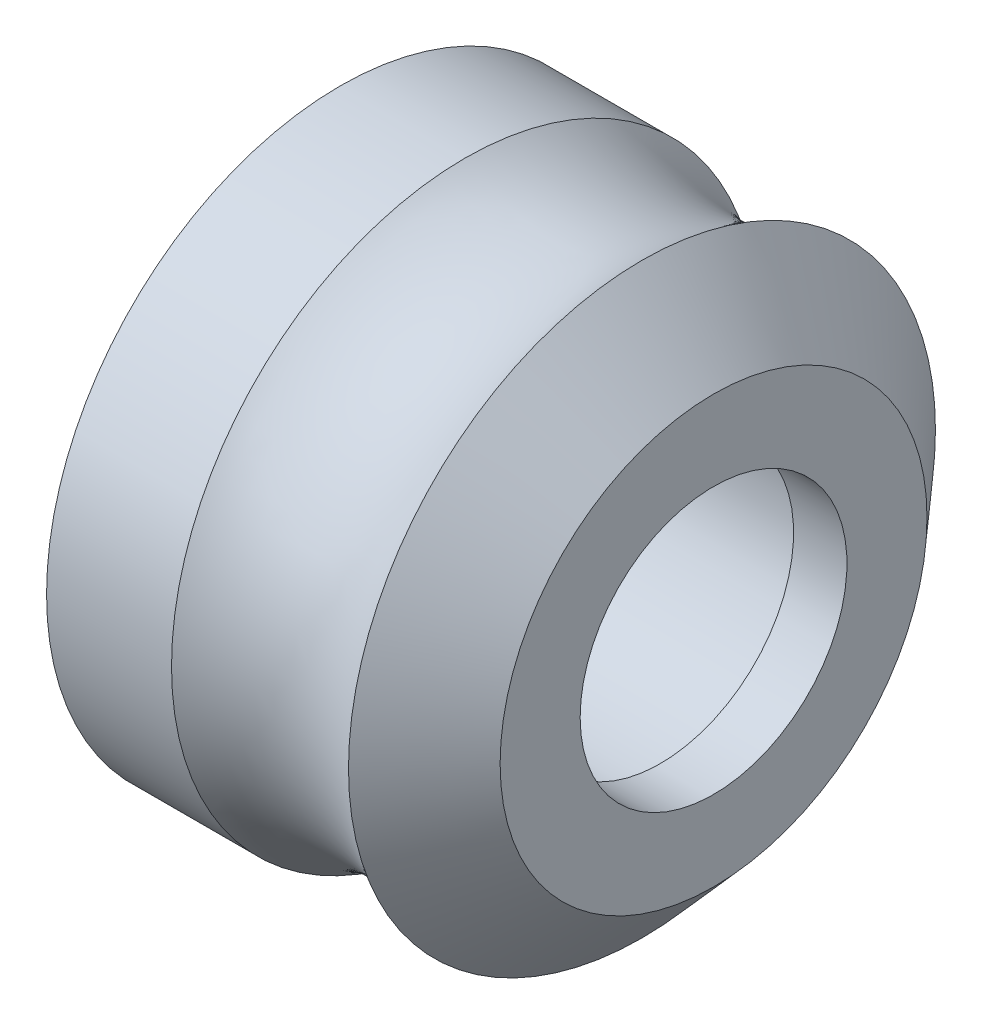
ISO-10303-21;
HEADER;
FILE_DESCRIPTION(('STEP AP214'),'2;1');
FILE_NAME('part.step','',(''),(''),'','','');
FILE_SCHEMA(('AUTOMOTIVE_DESIGN { 1 0 10303 214 1 1 1 1 }'));
ENDSEC;
DATA;
#1=APPLICATION_CONTEXT('core data for automotive mechanical design processes');
#2=APPLICATION_PROTOCOL_DEFINITION('international standard','automotive_design',2000,#1);
#3=PRODUCT_CONTEXT('',#1,'mechanical');
#4=PRODUCT('Part','Part','',(#3));
#5=PRODUCT_RELATED_PRODUCT_CATEGORY('part','',(#4));
#6=PRODUCT_DEFINITION_FORMATION('','',#4);
#7=PRODUCT_DEFINITION_CONTEXT('part definition',#1,'design');
#8=PRODUCT_DEFINITION('design','',#6,#7);
#9=PRODUCT_DEFINITION_SHAPE('','',#8);
#10=(LENGTH_UNIT() NAMED_UNIT(*) SI_UNIT(.MILLI.,.METRE.));
#11=(NAMED_UNIT(*) PLANE_ANGLE_UNIT() SI_UNIT($,.RADIAN.));
#12=(NAMED_UNIT(*) SI_UNIT($,.STERADIAN.) SOLID_ANGLE_UNIT());
#13=UNCERTAINTY_MEASURE_WITH_UNIT(LENGTH_MEASURE(1.E-05),#10,'distance_accuracy_value','');
#14=(GEOMETRIC_REPRESENTATION_CONTEXT(3) GLOBAL_UNCERTAINTY_ASSIGNED_CONTEXT((#13)) GLOBAL_UNIT_ASSIGNED_CONTEXT((#10,
#11,#12)) REPRESENTATION_CONTEXT('',''));
#15=CARTESIAN_POINT('',(0.,0.,0.));
#16=DIRECTION('',(0.,0.,1.));
#17=DIRECTION('',(1.,0.,0.));
#18=AXIS2_PLACEMENT_3D('',#15,#16,#17);
#19=CARTESIAN_POINT('',(0.,5.5,0.));
#20=DIRECTION('',(1.,0.,0.));
#21=DIRECTION('',(0.,0.,-1.));
#22=AXIS2_PLACEMENT_3D('',#19,#20,#21);
#23=PLANE('',#22);
#24=CARTESIAN_POINT('',(0.,0.,0.));
#25=DIRECTION('',(-1.,0.,0.));
#26=DIRECTION('',(0.,0.,1.));
#27=AXIS2_PLACEMENT_3D('',#24,#25,#26);
#28=CIRCLE('',#27,3.);
#29=CARTESIAN_POINT('',(0.,0.,3.));
#30=VERTEX_POINT('',#29);
#31=EDGE_CURVE('E10',#30,#30,#28,.T.);
#32=ORIENTED_EDGE('',*,*,#31,.F.);
#33=EDGE_LOOP('',(#32));
#34=FACE_BOUND('',#33,.T.);
#35=CARTESIAN_POINT('',(0.,0.,0.));
#36=DIRECTION('',(-1.,0.,0.));
#37=DIRECTION('',(0.,0.,1.));
#38=AXIS2_PLACEMENT_3D('',#35,#36,#37);
#39=CIRCLE('',#38,5.5);
#40=CARTESIAN_POINT('',(0.,0.,5.5));
#41=VERTEX_POINT('',#40);
#42=EDGE_CURVE('E43',#41,#41,#39,.T.);
#43=ORIENTED_EDGE('',*,*,#42,.T.);
#44=EDGE_LOOP('',(#43));
#45=FACE_BOUND('',#44,.T.);
#46=ADVANCED_FACE('F15',(#34,#45),#23,.F.);
#47=CARTESIAN_POINT('',(0.,0.,0.));
#48=DIRECTION('',(-1.,0.,0.));
#49=DIRECTION('',(0.,0.,1.));
#50=AXIS2_PLACEMENT_3D('',#47,#48,#49);
#51=CYLINDRICAL_SURFACE('',#50,3.);
#52=CARTESIAN_POINT('',(6.,0.,0.));
#53=DIRECTION('',(-1.,0.,0.));
#54=DIRECTION('',(0.,0.,1.));
#55=AXIS2_PLACEMENT_3D('',#52,#53,#54);
#56=CIRCLE('',#55,3.);
#57=CARTESIAN_POINT('',(6.,0.,3.));
#58=VERTEX_POINT('',#57);
#59=EDGE_CURVE('E21',#58,#58,#56,.T.);
#60=ORIENTED_EDGE('',*,*,#59,.F.);
#61=EDGE_LOOP('',(#60));
#62=FACE_BOUND('',#61,.T.);
#63=ORIENTED_EDGE('',*,*,#31,.T.);
#64=EDGE_LOOP('',(#63));
#65=FACE_BOUND('',#64,.T.);
#66=ADVANCED_FACE('F80',(#62,#65),#51,.F.);
#67=CARTESIAN_POINT('',(6.,3.,0.));
#68=DIRECTION('',(1.,0.,0.));
#69=DIRECTION('',(0.,0.,-1.));
#70=AXIS2_PLACEMENT_3D('',#67,#68,#69);
#71=PLANE('',#70);
#72=CARTESIAN_POINT('',(6.,0.,0.));
#73=DIRECTION('',(-1.,0.,0.));
#74=DIRECTION('',(0.,0.,1.));
#75=AXIS2_PLACEMENT_3D('',#72,#73,#74);
#76=CIRCLE('',#75,2.5);
#77=CARTESIAN_POINT('',(6.,0.,2.5));
#78=VERTEX_POINT('',#77);
#79=EDGE_CURVE('E25',#78,#78,#76,.T.);
#80=ORIENTED_EDGE('',*,*,#79,.F.);
#81=EDGE_LOOP('',(#80));
#82=FACE_BOUND('',#81,.T.);
#83=ORIENTED_EDGE('',*,*,#59,.T.);
#84=EDGE_LOOP('',(#83));
#85=FACE_BOUND('',#84,.T.);
#86=ADVANCED_FACE('F75',(#82,#85),#71,.F.);
#87=CARTESIAN_POINT('',(0.,0.,0.));
#88=DIRECTION('',(-1.,0.,0.));
#89=DIRECTION('',(0.,0.,1.));
#90=AXIS2_PLACEMENT_3D('',#87,#88,#89);
#91=CYLINDRICAL_SURFACE('',#90,2.5);
#92=CARTESIAN_POINT('',(7.,0.,0.));
#93=DIRECTION('',(-1.,0.,0.));
#94=DIRECTION('',(0.,0.,1.));
#95=AXIS2_PLACEMENT_3D('',#92,#93,#94);
#96=CIRCLE('',#95,2.5);
#97=CARTESIAN_POINT('',(7.,0.,2.5));
#98=VERTEX_POINT('',#97);
#99=EDGE_CURVE('E29',#98,#98,#96,.T.);
#100=ORIENTED_EDGE('',*,*,#99,.F.);
#101=EDGE_LOOP('',(#100));
#102=FACE_BOUND('',#101,.T.);
#103=ORIENTED_EDGE('',*,*,#79,.T.);
#104=EDGE_LOOP('',(#103));
#105=FACE_BOUND('',#104,.T.);
#106=ADVANCED_FACE('F69',(#102,#105),#91,.F.);
#107=CARTESIAN_POINT('',(7.,2.5,0.));
#108=DIRECTION('',(-1.,0.,0.));
#109=DIRECTION('',(0.,0.,1.));
#110=AXIS2_PLACEMENT_3D('',#107,#108,#109);
#111=PLANE('',#110);
#112=CARTESIAN_POINT('',(7.,0.,0.));
#113=DIRECTION('',(-1.,0.,0.));
#114=DIRECTION('',(0.,0.,1.));
#115=AXIS2_PLACEMENT_3D('',#112,#113,#114);
#116=CIRCLE('',#115,4.);
#117=CARTESIAN_POINT('',(7.,0.,4.));
#118=VERTEX_POINT('',#117);
#119=EDGE_CURVE('E34',#118,#118,#116,.T.);
#120=ORIENTED_EDGE('',*,*,#119,.F.);
#121=EDGE_LOOP('',(#120));
#122=FACE_BOUND('',#121,.T.);
#123=ORIENTED_EDGE('',*,*,#99,.T.);
#124=EDGE_LOOP('',(#123));
#125=FACE_BOUND('',#124,.T.);
#126=ADVANCED_FACE('F63',(#122,#125),#111,.F.);
#127=CARTESIAN_POINT('',(7.,0.,0.));
#128=DIRECTION('',(-1.,0.,0.));
#129=DIRECTION('',(0.,0.,1.));
#130=AXIS2_PLACEMENT_3D('',#127,#128,#129);
#131=CONICAL_SURFACE('',#130,4.,0.841051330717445);
#132=CARTESIAN_POINT('',(5.6583123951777,0.,0.));
#133=DIRECTION('',(-1.,0.,0.));
#134=DIRECTION('',(0.,0.,1.));
#135=AXIS2_PLACEMENT_3D('',#132,#133,#134);
#136=CIRCLE('',#135,5.5);
#137=CARTESIAN_POINT('',(5.6583123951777,0.,5.5));
#138=VERTEX_POINT('',#137);
#139=EDGE_CURVE('E37',#138,#138,#136,.T.);
#140=ORIENTED_EDGE('',*,*,#139,.F.);
#141=EDGE_LOOP('',(#140));
#142=FACE_BOUND('',#141,.T.);
#143=ORIENTED_EDGE('',*,*,#119,.T.);
#144=EDGE_LOOP('',(#143));
#145=FACE_BOUND('',#144,.T.);
#146=ADVANCED_FACE('F57',(#142,#145),#131,.T.);
#147=CARTESIAN_POINT('',(4.,0.,0.));
#148=DIRECTION('',(-1.,0.,0.));
#149=DIRECTION('',(0.,0.,1.));
#150=AXIS2_PLACEMENT_3D('',#147,#148,#149);
#151=TOROIDAL_SURFACE('',#150,8.,3.);
#152=CARTESIAN_POINT('',(2.3416876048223,0.,0.));
#153=DIRECTION('',(-1.,0.,0.));
#154=DIRECTION('',(0.,0.,1.));
#155=AXIS2_PLACEMENT_3D('',#152,#153,#154);
#156=CIRCLE('',#155,5.5);
#157=CARTESIAN_POINT('',(2.3416876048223,0.,5.5));
#158=VERTEX_POINT('',#157);
#159=EDGE_CURVE('E40',#158,#158,#156,.T.);
#160=ORIENTED_EDGE('',*,*,#159,.F.);
#161=EDGE_LOOP('',(#160));
#162=FACE_BOUND('',#161,.T.);
#163=ORIENTED_EDGE('',*,*,#139,.T.);
#164=EDGE_LOOP('',(#163));
#165=FACE_BOUND('',#164,.T.);
#166=ADVANCED_FACE('F51',(#162,#165),#151,.F.);
#167=CARTESIAN_POINT('',(0.,0.,0.));
#168=DIRECTION('',(-1.,0.,0.));
#169=DIRECTION('',(0.,0.,1.));
#170=AXIS2_PLACEMENT_3D('',#167,#168,#169);
#171=CYLINDRICAL_SURFACE('',#170,5.5);
#172=ORIENTED_EDGE('',*,*,#42,.F.);
#173=EDGE_LOOP('',(#172));
#174=FACE_BOUND('',#173,.T.);
#175=ORIENTED_EDGE('',*,*,#159,.T.);
#176=EDGE_LOOP('',(#175));
#177=FACE_BOUND('',#176,.T.);
#178=ADVANCED_FACE('F48',(#174,#177),#171,.T.);
#179=CLOSED_SHELL('',(#46,#66,#86,#106,#126,#146,#166,#178));
#180=MANIFOLD_SOLID_BREP('B1',#179);
#181=ADVANCED_BREP_SHAPE_REPRESENTATION('',(#18,#180),#14);
#182=SHAPE_DEFINITION_REPRESENTATION(#9,#181);
ENDSEC;
END-ISO-10303-21;
